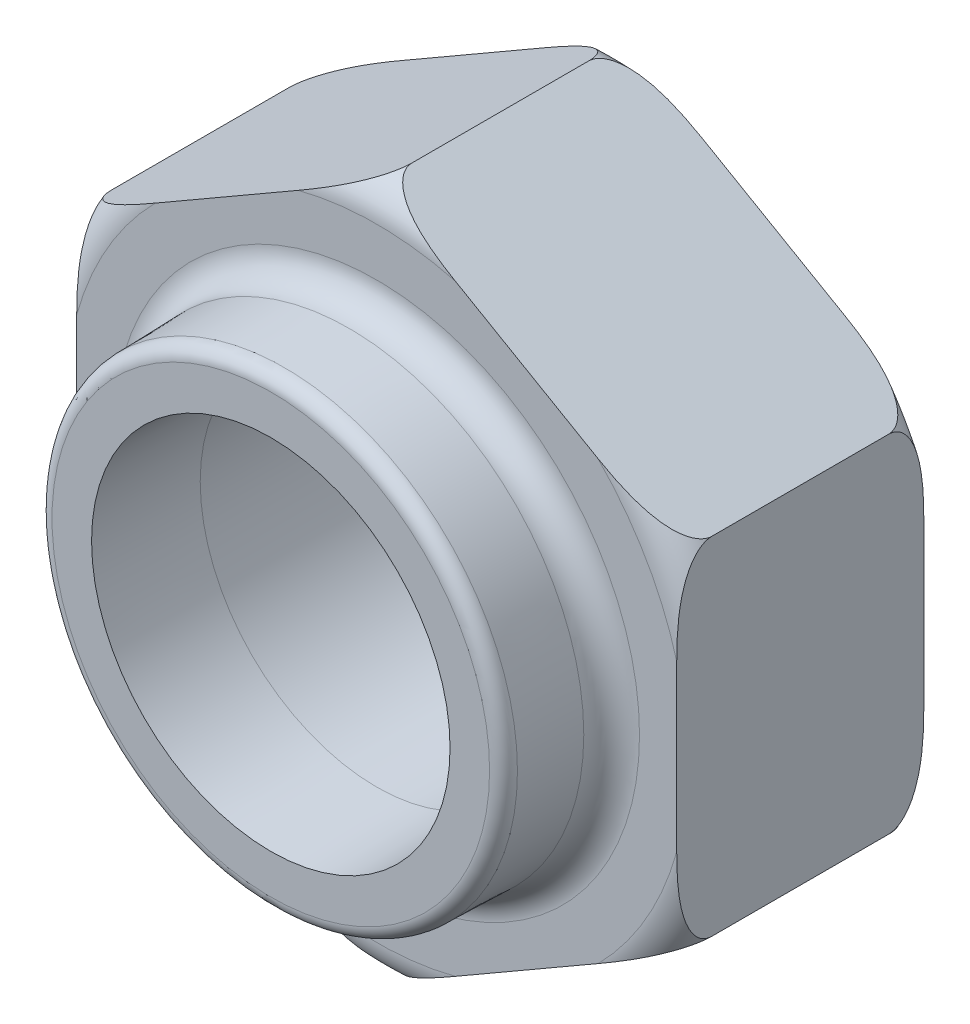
from build123d import *

# Parameters (mm, degrees)
TETE_DEPTH                 = 7
ESQUISSE3_R                = 5
ENL_V_DE_MAT_EXTRU_1_DEPTH = 15.750706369
ESQUISSE4_R                = 6.666666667
ESQUISSE4_R_2              = 5
BOSS_EXTRU_1_DEPTH         = 3
BOSS_EXTRU_1_DRAFT         = 1.499999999
CONG_1_R                   = 0.8
CONG_3_R                   = 0.4


with BuildPart() as part:
    # Esquisse1 → Tete (new body)
    with BuildSketch(Plane.XY):
        Polygon((-8.5, 4.907477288), (-8.5, -4.907477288), (0, -9.814954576), (8.5, -4.907477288), (8.5, 4.907477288), (0, 9.814954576), align=None)
    extrude(amount=TETE_DEPTH)

    # Esquisse2 → Rayon de tete (revolve, cut)
    with BuildSketch(Plane(origin=(0, 0, 0), x_dir=(0, 0, -1), z_dir=(1, 0, 0))):
        with BuildLine():
            Line((-1, -9.814954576), (-1, -19.814954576))
            Line((-1, -19.814954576), (8.771054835, -19.814954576))
            Line((8.771054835, -19.814954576), (8.771054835, -8.814954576))
            Line((8.771054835, -8.814954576), (0, -8.814954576))
            ThreePointArc((0, -8.814954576), (-0.292893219, -9.522061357), (-1, -9.814954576))
        make_face()
    rayon_de_tete = revolve(axis=Axis((0, 0, 0), (0, 0, 1)), mode=Mode.SUBTRACT)

    # Sym_trie1: Rayon de tete across plane
    add(rayon_de_tete.mirror(Plane.XY.offset(3.5)), mode=Mode.SUBTRACT)

    # Esquisse3 → Enl_v. de mat.-Extru.1 (cut, through all)
    with BuildSketch(Plane(origin=(0, 0, 0), x_dir=(-1, 0, 0), z_dir=(0, 0, -1))):
        Circle(ESQUISSE3_R)
    extrude(amount=-ENL_V_DE_MAT_EXTRU_1_DEPTH, mode=Mode.SUBTRACT)


with BuildPart() as boss_extru_1_tool:
    # Esquisse4 → Boss.-Extru.1 (with draft: the straight prism first)
    with BuildSketch(Plane.XY.offset(7)):
        Circle(ESQUISSE4_R)
        with Locations(Location((0, 0, 0), (0, 0, 180))):
            Circle(ESQUISSE4_R_2, mode=Mode.SUBTRACT)
    extrude(amount=BOSS_EXTRU_1_DEPTH)
    # Boss.-Extru.1: the draft: its side faces are tilted about the plane it starts from
    boss_extru_1_sides = [boss_extru_1_tool.faces().sort_by_distance(p)[0] for p in [
        (-6.666666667, 0, 8.5),
        (5, 0, 8.5),
    ]]
    draft(boss_extru_1_sides, Plane.XY.offset(7), BOSS_EXTRU_1_DRAFT)


with BuildPart() as part_1:
    add(part.part)

    # Boss.-Extru.1: add boss_extru_1_tool
    add(boss_extru_1_tool.part)

    # Cong_1
    cong_1_edges = [part_1.edges().sort_by_distance(p)[0] for p in [
        (-6.666666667, 0, 7),
    ]]
    fillet(cong_1_edges, radius=CONG_1_R)

    # Cong_3
    cong_3_edges = [part_1.edges().sort_by_distance(p)[0] for p in [
        (-6.588108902, 0, 10),
    ]]
    fillet(cong_3_edges, radius=CONG_3_R)


solid = part_1.part
